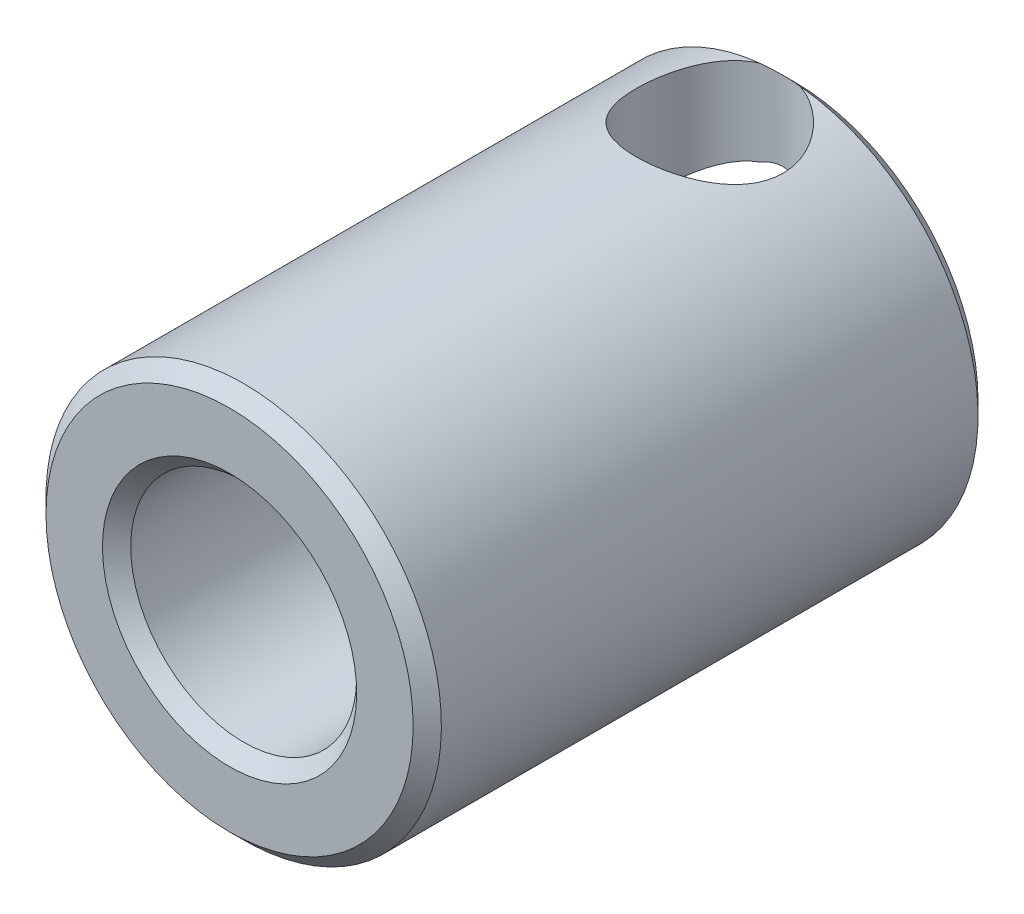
ISO-10303-21;
HEADER;
FILE_DESCRIPTION(('STEP AP214'),'2;1');
FILE_NAME('part.step','',(''),(''),'','','');
FILE_SCHEMA(('AUTOMOTIVE_DESIGN { 1 0 10303 214 1 1 1 1 }'));
ENDSEC;
DATA;
#1=APPLICATION_CONTEXT('core data for automotive mechanical design processes');
#2=APPLICATION_PROTOCOL_DEFINITION('international standard','automotive_design',2000,#1);
#3=PRODUCT_CONTEXT('',#1,'mechanical');
#4=PRODUCT('Part','Part','',(#3));
#5=PRODUCT_RELATED_PRODUCT_CATEGORY('part','',(#4));
#6=PRODUCT_DEFINITION_FORMATION('','',#4);
#7=PRODUCT_DEFINITION_CONTEXT('part definition',#1,'design');
#8=PRODUCT_DEFINITION('design','',#6,#7);
#9=PRODUCT_DEFINITION_SHAPE('','',#8);
#10=(LENGTH_UNIT() NAMED_UNIT(*) SI_UNIT(.MILLI.,.METRE.));
#11=(NAMED_UNIT(*) PLANE_ANGLE_UNIT() SI_UNIT($,.RADIAN.));
#12=(NAMED_UNIT(*) SI_UNIT($,.STERADIAN.) SOLID_ANGLE_UNIT());
#13=UNCERTAINTY_MEASURE_WITH_UNIT(LENGTH_MEASURE(1.E-05),#10,'distance_accuracy_value','');
#14=(GEOMETRIC_REPRESENTATION_CONTEXT(3) GLOBAL_UNCERTAINTY_ASSIGNED_CONTEXT((#13)) GLOBAL_UNIT_ASSIGNED_CONTEXT((#10,
#11,#12)) REPRESENTATION_CONTEXT('',''));
#15=CARTESIAN_POINT('',(0.,0.,0.));
#16=DIRECTION('',(0.,0.,1.));
#17=DIRECTION('',(1.,0.,0.));
#18=AXIS2_PLACEMENT_3D('',#15,#16,#17);
#19=CARTESIAN_POINT('',(0.,0.,20.));
#20=DIRECTION('',(0.,0.,-1.));
#21=DIRECTION('',(-1.,0.,0.));
#22=AXIS2_PLACEMENT_3D('',#19,#20,#21);
#23=CYLINDRICAL_SURFACE('',#22,7.);
#24=CARTESIAN_POINT('',(0.,0.,19.5));
#25=DIRECTION('',(0.,0.,1.));
#26=DIRECTION('',(0.,1.,0.));
#27=AXIS2_PLACEMENT_3D('',#24,#25,#26);
#28=CIRCLE('',#27,7.);
#29=CARTESIAN_POINT('',(0.,7.,19.5));
#30=VERTEX_POINT('',#29);
#31=EDGE_CURVE('E49',#30,#30,#28,.F.);
#32=ORIENTED_EDGE('',*,*,#31,.T.);
#33=EDGE_LOOP('',(#32));
#34=FACE_BOUND('',#33,.T.);
#35=CARTESIAN_POINT('',(0.,7.,0.4));
#36=CARTESIAN_POINT('',(0.140902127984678,7.00000340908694,0.399995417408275));
#37=CARTESIAN_POINT('',(0.281772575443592,6.99570847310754,0.411489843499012));
#38=CARTESIAN_POINT('',(0.559308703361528,6.97900377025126,0.456981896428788));
#39=CARTESIAN_POINT('',(0.69597489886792,6.96659500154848,0.490976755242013));
#40=CARTESIAN_POINT('',(0.961060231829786,6.93499607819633,0.580105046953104));
#41=CARTESIAN_POINT('',(1.08949454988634,6.9158188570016,0.635198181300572));
#42=CARTESIAN_POINT('',(1.33529005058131,6.87259728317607,0.764756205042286));
#43=CARTESIAN_POINT('',(1.45264831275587,6.84855165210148,0.839226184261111));
#44=CARTESIAN_POINT('',(1.67786429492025,6.79695712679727,1.00867578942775));
#45=CARTESIAN_POINT('',(1.78519764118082,6.76931039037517,1.10432230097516));
#46=CARTESIAN_POINT('',(1.98272113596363,6.71411603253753,1.31199410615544));
#47=CARTESIAN_POINT('',(2.07290618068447,6.68656844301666,1.42402425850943));
#48=CARTESIAN_POINT('',(2.23687620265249,6.63355869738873,1.66637033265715));
#49=CARTESIAN_POINT('',(2.309925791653,6.6082123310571,1.79721167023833));
#50=CARTESIAN_POINT('',(2.43275023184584,6.56399417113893,2.07041309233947));
#51=CARTESIAN_POINT('',(2.48253417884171,6.54511984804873,2.21276864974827));
#52=CARTESIAN_POINT('',(2.5553531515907,6.51702746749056,2.49892679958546));
#53=CARTESIAN_POINT('',(2.57938744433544,6.50745015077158,2.64243866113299));
#54=CARTESIAN_POINT('',(2.60314935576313,6.49798380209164,2.93175348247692));
#55=CARTESIAN_POINT('',(2.60288677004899,6.49809086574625,3.07755549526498));
#56=CARTESIAN_POINT('',(2.57882752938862,6.50767095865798,3.35822753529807));
#57=CARTESIAN_POINT('',(2.55640932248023,6.51659539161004,3.49323790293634));
#58=CARTESIAN_POINT('',(2.49095130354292,6.54189421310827,3.75742220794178));
#59=CARTESIAN_POINT('',(2.44790844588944,6.55826970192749,3.88659528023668));
#60=CARTESIAN_POINT('',(2.34165335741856,6.59696112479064,4.13827617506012));
#61=CARTESIAN_POINT('',(2.27807915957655,6.61938237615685,4.26061427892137));
#62=CARTESIAN_POINT('',(2.13281821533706,6.6676031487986,4.49328919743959));
#63=CARTESIAN_POINT('',(2.05112529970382,6.69340381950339,4.60362190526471));
#64=CARTESIAN_POINT('',(1.86561162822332,6.74754880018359,4.81679505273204));
#65=CARTESIAN_POINT('',(1.76068817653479,6.7759487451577,4.9186640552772));
#66=CARTESIAN_POINT('',(1.5349179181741,6.83062982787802,5.10364628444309));
#67=CARTESIAN_POINT('',(1.41406876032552,6.8569106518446,5.18675673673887));
#68=CARTESIAN_POINT('',(1.15743751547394,6.90489731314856,5.3329069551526));
#69=CARTESIAN_POINT('',(1.02145960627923,6.92652907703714,5.39562891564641));
#70=CARTESIAN_POINT('',(0.739879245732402,6.96223204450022,5.49698648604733));
#71=CARTESIAN_POINT('',(0.594281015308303,6.9763065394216,5.5356325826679));
#72=CARTESIAN_POINT('',(0.305773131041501,6.99473357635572,5.58588709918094));
#73=CARTESIAN_POINT('',(0.163121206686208,6.99955613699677,5.59880404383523));
#74=CARTESIAN_POINT('',(-0.122376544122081,7.00038457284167,5.60103632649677));
#75=CARTESIAN_POINT('',(-0.265222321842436,6.99639235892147,5.59035677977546));
#76=CARTESIAN_POINT('',(-0.541435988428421,6.98035004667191,5.54669781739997));
#77=CARTESIAN_POINT('',(-0.674958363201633,6.96860812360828,5.51457074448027));
#78=CARTESIAN_POINT('',(-0.934627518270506,6.93855669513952,5.43004585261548));
#79=CARTESIAN_POINT('',(-1.06077333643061,6.92024633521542,5.37764539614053));
#80=CARTESIAN_POINT('',(-1.30622972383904,6.87820684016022,5.25239914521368));
#81=CARTESIAN_POINT('',(-1.42523360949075,6.85433523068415,5.17900159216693));
#82=CARTESIAN_POINT('',(-1.64963112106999,6.80382009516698,5.01447034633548));
#83=CARTESIAN_POINT('',(-1.75501976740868,6.77717556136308,4.9233301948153));
#84=CARTESIAN_POINT('',(-1.95546470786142,6.72217031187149,4.71979576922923));
#85=CARTESIAN_POINT('',(-2.04959193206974,6.69379820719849,4.60648723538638));
#86=CARTESIAN_POINT('',(-2.21767356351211,6.64001014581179,4.36511926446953));
#87=CARTESIAN_POINT('',(-2.29162634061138,6.61459442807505,4.23705863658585));
#88=CARTESIAN_POINT('',(-2.41728845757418,6.56971904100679,3.96887010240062));
#89=CARTESIAN_POINT('',(-2.46891958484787,6.55028038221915,3.82870179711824));
#90=CARTESIAN_POINT('',(-2.54751642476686,6.52012013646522,3.54073962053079));
#91=CARTESIAN_POINT('',(-2.57449700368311,6.50939329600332,3.39295040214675));
#92=CARTESIAN_POINT('',(-2.60171215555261,6.49856044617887,3.10398712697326));
#93=CARTESIAN_POINT('',(-2.60352712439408,6.49782691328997,2.96298416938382));
#94=CARTESIAN_POINT('',(-2.58439424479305,6.50546005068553,2.68279574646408));
#95=CARTESIAN_POINT('',(-2.56344847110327,6.51382589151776,2.54361011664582));
#96=CARTESIAN_POINT('',(-2.50061005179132,6.53819746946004,2.27515018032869));
#97=CARTESIAN_POINT('',(-2.45935063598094,6.55397162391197,2.14570484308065));
#98=CARTESIAN_POINT('',(-2.35760940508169,6.59125168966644,1.8954955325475));
#99=CARTESIAN_POINT('',(-2.29712277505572,6.61275903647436,1.77473374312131));
#100=CARTESIAN_POINT('',(-2.15501364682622,6.66046565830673,1.53853411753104));
#101=CARTESIAN_POINT('',(-2.07246017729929,6.68685000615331,1.42369421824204));
#102=CARTESIAN_POINT('',(-1.89001350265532,6.74068894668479,1.20899196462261));
#103=CARTESIAN_POINT('',(-1.7901148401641,6.76814387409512,1.10913434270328));
#104=CARTESIAN_POINT('',(-1.5695204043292,6.82276788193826,0.921872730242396));
#105=CARTESIAN_POINT('',(-1.44800627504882,6.84984571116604,0.835401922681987));
#106=CARTESIAN_POINT('',(-1.19122351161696,6.899134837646,0.684144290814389));
#107=CARTESIAN_POINT('',(-1.0559542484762,6.92134591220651,0.619358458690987));
#108=CARTESIAN_POINT('',(-0.770373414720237,6.95901970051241,0.511909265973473));
#109=CARTESIAN_POINT('',(-0.619699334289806,6.97421640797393,0.470107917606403));
#110=CARTESIAN_POINT('',(-0.312668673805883,6.99470230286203,0.414162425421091));
#111=CARTESIAN_POINT('',(-0.156314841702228,6.99999621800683,0.400005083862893));
#112=CARTESIAN_POINT('',(0.,7.,0.4));
#113=B_SPLINE_CURVE_WITH_KNOTS('',3,(#35,#36,#37,#38,#39,#40,#41,#42,#43,#44,#45,#46,#47,#48,
#49,#50,#51,#52,#53,#54,#55,#56,#57,#58,#59,#60,#61,#62,#63,#64,#65,#66,#67,#68,#69,#70,#71,#72,
#73,#74,#75,#76,#77,#78,#79,#80,#81,#82,#83,#84,#85,#86,#87,#88,#89,#90,#91,#92,#93,#94,#95,#96,
#97,#98,#99,#100,#101,#102,#103,#104,#105,#106,#107,#108,#109,#110,#111,#112),.UNSPECIFIED.,.T.,
.F.,(4,2,2,2,2,2,2,2,2,2,2,2,2,2,2,2,2,2,2,2,2,2,2,2,2,2,2,2,2,2,2,2,2,2,2,2,2,2,4),(0.,
0.42212993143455,0.844207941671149,1.26548375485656,1.68687033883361,2.12412948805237,
2.56151857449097,3.01518807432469,3.46868006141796,3.90385364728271,4.33885178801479,
4.74838765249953,5.15798401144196,5.57523654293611,5.99263136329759,6.43750488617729,
6.88244416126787,7.33401897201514,7.78539695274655,8.213164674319,8.64083967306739,
9.05245687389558,9.46412764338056,9.88780578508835,10.3116384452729,10.7595862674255,
11.2075702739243,11.6571114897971,12.1063814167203,12.5272995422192,12.9481793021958,
13.3566987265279,13.7653205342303,14.1950659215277,14.6249467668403,15.0774737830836,
15.5300215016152,15.9985502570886,16.4668552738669),.UNSPECIFIED.);
#114=CARTESIAN_POINT('',(0.714142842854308,6.96347614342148,0.499999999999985));
#115=VERTEX_POINT('',#114);
#116=CARTESIAN_POINT('',(-0.714142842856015,6.96347614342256,0.499999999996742));
#117=VERTEX_POINT('',#116);
#118=EDGE_CURVE('E58',#115,#117,#113,.T.);
#119=ORIENTED_EDGE('',*,*,#118,.T.);
#120=CARTESIAN_POINT('',(0.,0.,0.5));
#121=DIRECTION('',(0.,0.,1.));
#122=DIRECTION('',(0.,1.,0.));
#123=AXIS2_PLACEMENT_3D('',#120,#121,#122);
#124=CIRCLE('',#123,7.);
#125=EDGE_CURVE('E195',#117,#115,#124,.T.);
#126=ORIENTED_EDGE('',*,*,#125,.T.);
#127=EDGE_LOOP('',(#119,#126));
#128=FACE_BOUND('',#127,.T.);
#129=ADVANCED_FACE('F14',(#34,#128),#23,.T.);
#130=CARTESIAN_POINT('',(0.,0.,20.));
#131=DIRECTION('',(0.,0.,-1.));
#132=DIRECTION('',(-1.,0.,0.));
#133=AXIS2_PLACEMENT_3D('',#130,#131,#132);
#134=CYLINDRICAL_SURFACE('',#133,4.);
#135=CARTESIAN_POINT('',(0.,0.,19.5));
#136=DIRECTION('',(0.,0.,1.));
#137=DIRECTION('',(0.,1.,0.));
#138=AXIS2_PLACEMENT_3D('',#135,#136,#137);
#139=CIRCLE('',#138,4.);
#140=CARTESIAN_POINT('',(0.,4.,19.5));
#141=VERTEX_POINT('',#140);
#142=EDGE_CURVE('E54',#141,#141,#139,.T.);
#143=ORIENTED_EDGE('',*,*,#142,.T.);
#144=EDGE_LOOP('',(#143));
#145=FACE_BOUND('',#144,.T.);
#146=CARTESIAN_POINT('',(0.,4.,0.4));
#147=CARTESIAN_POINT('',(-0.131242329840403,3.99999329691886,0.40000738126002));
#148=CARTESIAN_POINT('',(-0.26254087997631,3.9934798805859,0.409997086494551));
#149=CARTESIAN_POINT('',(-0.520991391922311,3.96805748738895,0.449372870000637));
#150=CARTESIAN_POINT('',(-0.648139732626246,3.94913797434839,0.478775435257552));
#151=CARTESIAN_POINT('',(-0.894153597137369,3.90078759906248,0.555206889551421));
#152=CARTESIAN_POINT('',(-1.01305512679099,3.87140638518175,0.602152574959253));
#153=CARTESIAN_POINT('',(-1.24084842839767,3.8045247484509,0.711706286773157));
#154=CARTESIAN_POINT('',(-1.3497392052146,3.76702351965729,0.774315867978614));
#155=CARTESIAN_POINT('',(-1.56461434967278,3.68325347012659,0.919101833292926));
#156=CARTESIAN_POINT('',(-1.66960870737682,3.63651545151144,1.00247034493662));
#157=CARTESIAN_POINT('',(-1.86507260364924,3.54025458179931,1.18360410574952));
#158=CARTESIAN_POINT('',(-1.95552160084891,3.49072792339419,1.28138934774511));
#159=CARTESIAN_POINT('',(-2.13305930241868,3.38558669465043,1.50552739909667));
#160=CARTESIAN_POINT('',(-2.21764773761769,3.33016214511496,1.63396599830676));
#161=CARTESIAN_POINT('',(-2.36387198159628,3.22801420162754,1.90642481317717));
#162=CARTESIAN_POINT('',(-2.42554737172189,3.1812758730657,2.05041759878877));
#163=CARTESIAN_POINT('',(-2.50925136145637,3.11539311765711,2.30955747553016));
#164=CARTESIAN_POINT('',(-2.53752995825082,3.09219132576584,2.42164521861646));
#165=CARTESIAN_POINT('',(-2.57898335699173,3.05771041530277,2.65029679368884));
#166=CARTESIAN_POINT('',(-2.59218224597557,3.04641228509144,2.7668531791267));
#167=CARTESIAN_POINT('',(-2.60266135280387,3.03746806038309,3.00162985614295));
#168=CARTESIAN_POINT('',(-2.59988682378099,3.03986891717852,3.11985448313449));
#169=CARTESIAN_POINT('',(-2.57849148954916,3.05803219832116,3.35385226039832));
#170=CARTESIAN_POINT('',(-2.55985742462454,3.07380580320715,3.46962327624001));
#171=CARTESIAN_POINT('',(-2.50881501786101,3.1155853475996,3.6916580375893));
#172=CARTESIAN_POINT('',(-2.4769094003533,3.14121548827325,3.7981125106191));
#173=CARTESIAN_POINT('',(-2.40072387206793,3.19981705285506,4.00430078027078));
#174=CARTESIAN_POINT('',(-2.35643988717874,3.23279089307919,4.10403235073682));
#175=CARTESIAN_POINT('',(-2.24673614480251,3.31021385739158,4.3148988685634));
#176=CARTESIAN_POINT('',(-2.17886980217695,3.3556433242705,4.42439872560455));
#177=CARTESIAN_POINT('',(-2.02828712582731,3.44875456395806,4.63171492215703));
#178=CARTESIAN_POINT('',(-1.94555285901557,3.49643900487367,4.72951691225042));
#179=CARTESIAN_POINT('',(-1.74873460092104,3.5995192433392,4.93010851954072));
#180=CARTESIAN_POINT('',(-1.63168281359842,3.65461273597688,5.03017369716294));
#181=CARTESIAN_POINT('',(-1.37948895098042,3.75705675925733,5.20926550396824));
#182=CARTESIAN_POINT('',(-1.24436566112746,3.80441521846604,5.2883137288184));
#183=CARTESIAN_POINT('',(-0.987177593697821,3.87810197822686,5.40862009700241));
#184=CARTESIAN_POINT('',(-0.867825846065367,3.90673767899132,5.4542618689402));
#185=CARTESIAN_POINT('',(-0.62180392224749,3.95335158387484,5.52780629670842));
#186=CARTESIAN_POINT('',(-0.495139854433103,3.97133854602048,5.55572353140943));
#187=CARTESIAN_POINT('',(-0.23742381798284,3.99505026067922,5.59241697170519));
#188=CARTESIAN_POINT('',(-0.106357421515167,4.00072966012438,5.60112238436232));
#189=CARTESIAN_POINT('',(0.155513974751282,3.99911931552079,5.5986452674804));
#190=CARTESIAN_POINT('',(0.28631897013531,3.99182935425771,5.5874624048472));
#191=CARTESIAN_POINT('',(0.535832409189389,3.96581617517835,5.54713828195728));
#192=CARTESIAN_POINT('',(0.654798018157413,3.94779725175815,5.51910232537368));
#193=CARTESIAN_POINT('',(0.885994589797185,3.90242300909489,5.44738115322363));
#194=CARTESIAN_POINT('',(0.998224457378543,3.87506617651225,5.40369340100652));
#195=CARTESIAN_POINT('',(1.22143058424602,3.81084256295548,5.29877417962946));
#196=CARTESIAN_POINT('',(1.3317766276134,3.77344664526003,5.2365337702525));
#197=CARTESIAN_POINT('',(1.54093180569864,3.69298130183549,5.09792655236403));
#198=CARTESIAN_POINT('',(1.63973252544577,3.64990778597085,5.02154954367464));
#199=CARTESIAN_POINT('',(1.83914998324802,3.55409295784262,4.84338905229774));
#200=CARTESIAN_POINT('',(1.93766759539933,3.50088886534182,4.73950211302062));
#201=CARTESIAN_POINT('',(2.11669261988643,3.3956438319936,4.51659420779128));
#202=CARTESIAN_POINT('',(2.19719270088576,3.34360337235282,4.39756711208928));
#203=CARTESIAN_POINT('',(2.32999289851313,3.25220537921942,4.16073084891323));
#204=CARTESIAN_POINT('',(2.38451159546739,3.21207543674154,4.0444705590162));
#205=CARTESIAN_POINT('',(2.47639525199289,3.14178831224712,3.8025770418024));
#206=CARTESIAN_POINT('',(2.51379111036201,3.11161319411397,3.67696117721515));
#207=CARTESIAN_POINT('',(2.56522627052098,3.06929348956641,3.43837701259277));
#208=CARTESIAN_POINT('',(2.58193539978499,3.05511753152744,3.32635400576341));
#209=CARTESIAN_POINT('',(2.6005371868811,3.03930433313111,3.10023470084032));
#210=CARTESIAN_POINT('',(2.60244128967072,3.03765740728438,2.98614007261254));
#211=CARTESIAN_POINT('',(2.59132574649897,3.04714201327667,2.75933297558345));
#212=CARTESIAN_POINT('',(2.57831712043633,3.05826410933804,2.64661954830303));
#213=CARTESIAN_POINT('',(2.53820790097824,3.09162789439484,2.42538703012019));
#214=CARTESIAN_POINT('',(2.51108917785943,3.11388388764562,2.31687352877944));
#215=CARTESIAN_POINT('',(2.43418115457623,3.1745537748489,2.07522359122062));
#216=CARTESIAN_POINT('',(2.38007932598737,3.21579043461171,1.94417788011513));
#217=CARTESIAN_POINT('',(2.25291901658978,3.30612081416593,1.69460918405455));
#218=CARTESIAN_POINT('',(2.17983462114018,3.35522523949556,1.57610363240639));
#219=CARTESIAN_POINT('',(2.01515794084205,3.45667900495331,1.35110588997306));
#220=CARTESIAN_POINT('',(1.92329614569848,3.50906686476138,1.24482856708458));
#221=CARTESIAN_POINT('',(1.72305889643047,3.61161392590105,1.04786851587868));
#222=CARTESIAN_POINT('',(1.61467948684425,3.66177258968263,0.957189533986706));
#223=CARTESIAN_POINT('',(1.37081527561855,3.76028651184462,0.785228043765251));
#224=CARTESIAN_POINT('',(1.23370112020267,3.80795408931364,0.705805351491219));
#225=CARTESIAN_POINT('',(1.01672423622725,3.8693611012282,0.6057087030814));
#226=CARTESIAN_POINT('',(0.942542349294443,3.88814289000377,0.575523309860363));
#227=CARTESIAN_POINT('',(0.79093276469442,3.92179078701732,0.521919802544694));
#228=CARTESIAN_POINT('',(0.713506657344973,3.93665878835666,0.498498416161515));
#229=CARTESIAN_POINT('',(0.531962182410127,3.96583403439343,0.452797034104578));
#230=CARTESIAN_POINT('',(0.426930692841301,3.97857524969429,0.433063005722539));
#231=CARTESIAN_POINT('',(0.214611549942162,3.99565973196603,0.406663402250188));
#232=CARTESIAN_POINT('',(0.107324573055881,4.00000548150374,0.3999939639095));
#233=CARTESIAN_POINT('',(0.,4.,0.4));
#234=B_SPLINE_CURVE_WITH_KNOTS('',3,(#146,#147,#148,#149,#150,#151,#152,#153,#154,#155,#156,
#157,#158,#159,#160,#161,#162,#163,#164,#165,#166,#167,#168,#169,#170,#171,#172,#173,#174,#175,
#176,#177,#178,#179,#180,#181,#182,#183,#184,#185,#186,#187,#188,#189,#190,#191,#192,#193,#194,
#195,#196,#197,#198,#199,#200,#201,#202,#203,#204,#205,#206,#207,#208,#209,#210,#211,#212,#213,
#214,#215,#216,#217,#218,#219,#220,#221,#222,#223,#224,#225,#226,#227,#228,#229,#230,#231,#232,
#233),.UNSPECIFIED.,.T.,.F.,(4,2,2,2,2,2,2,2,2,2,2,2,2,2,2,2,2,2,2,2,2,2,2,2,2,2,2,2,2,2,2,2,2,
2,2,2,2,2,2,2,2,2,2,4),(0.,0.393303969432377,0.786942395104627,1.1787370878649,1.57057068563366,
1.99490086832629,2.419825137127,2.90794425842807,3.39521620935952,3.74750251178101,
4.09922531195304,4.45215431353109,4.8053786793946,5.1462917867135,5.48731723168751,
5.89565988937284,6.30449842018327,6.79278996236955,7.28057781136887,7.67176869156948,
8.0626373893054,8.45494399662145,8.8472571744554,9.21628489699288,9.58537245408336,
9.98013330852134,10.3751801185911,10.8315540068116,11.288113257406,11.6902028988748,
12.0915640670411,12.4324642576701,12.7731008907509,13.1134859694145,13.4543094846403,
13.8949021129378,14.3360994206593,14.7841406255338,15.2322892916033,15.7254702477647,
15.9718878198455,16.2181859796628,16.5399089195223,16.8615367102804),.UNSPECIFIED.);
#235=CARTESIAN_POINT('',(-0.714142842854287,3.93573373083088,0.5));
#236=VERTEX_POINT('',#235);
#237=CARTESIAN_POINT('',(0.714142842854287,3.93573373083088,0.5));
#238=VERTEX_POINT('',#237);
#239=EDGE_CURVE('E53',#236,#238,#234,.T.);
#240=ORIENTED_EDGE('',*,*,#239,.T.);
#241=CARTESIAN_POINT('',(0.,0.,0.5));
#242=DIRECTION('',(0.,0.,1.));
#243=DIRECTION('',(0.,1.,0.));
#244=AXIS2_PLACEMENT_3D('',#241,#242,#243);
#245=CIRCLE('',#244,4.);
#246=EDGE_CURVE('E45',#238,#236,#245,.F.);
#247=ORIENTED_EDGE('',*,*,#246,.T.);
#248=EDGE_LOOP('',(#240,#247));
#249=FACE_BOUND('',#248,.T.);
#250=ADVANCED_FACE('F52',(#145,#249),#134,.F.);
#251=CARTESIAN_POINT('',(0.,0.,20.));
#252=DIRECTION('',(0.,0.,1.));
#253=DIRECTION('',(1.,0.,0.));
#254=AXIS2_PLACEMENT_3D('',#251,#252,#253);
#255=PLANE('',#254);
#256=CARTESIAN_POINT('',(0.,0.,20.));
#257=DIRECTION('',(0.,0.,1.));
#258=DIRECTION('',(0.,1.,0.));
#259=AXIS2_PLACEMENT_3D('',#256,#257,#258);
#260=CIRCLE('',#259,6.5);
#261=CARTESIAN_POINT('',(0.,6.5,20.));
#262=VERTEX_POINT('',#261);
#263=EDGE_CURVE('E9',#262,#262,#260,.T.);
#264=ORIENTED_EDGE('',*,*,#263,.T.);
#265=EDGE_LOOP('',(#264));
#266=FACE_BOUND('',#265,.T.);
#267=CARTESIAN_POINT('',(0.,0.,20.));
#268=DIRECTION('',(0.,0.,1.));
#269=DIRECTION('',(0.,1.,0.));
#270=AXIS2_PLACEMENT_3D('',#267,#268,#269);
#271=CIRCLE('',#270,4.5);
#272=CARTESIAN_POINT('',(0.,4.5,20.));
#273=VERTEX_POINT('',#272);
#274=EDGE_CURVE('E22',#273,#273,#271,.F.);
#275=ORIENTED_EDGE('',*,*,#274,.T.);
#276=EDGE_LOOP('',(#275));
#277=FACE_BOUND('',#276,.T.);
#278=ADVANCED_FACE('F119',(#266,#277),#255,.T.);
#279=CARTESIAN_POINT('',(0.,0.,0.));
#280=DIRECTION('',(0.,0.,1.));
#281=DIRECTION('',(1.,0.,0.));
#282=AXIS2_PLACEMENT_3D('',#279,#280,#281);
#283=PLANE('',#282);
#284=CARTESIAN_POINT('',(0.,0.,0.));
#285=DIRECTION('',(0.,0.,1.));
#286=DIRECTION('',(0.,1.,0.));
#287=AXIS2_PLACEMENT_3D('',#284,#285,#286);
#288=CIRCLE('',#287,4.5);
#289=CARTESIAN_POINT('',(0.,4.5,0.));
#290=VERTEX_POINT('',#289);
#291=EDGE_CURVE('E61',#290,#290,#288,.T.);
#292=ORIENTED_EDGE('',*,*,#291,.T.);
#293=EDGE_LOOP('',(#292));
#294=FACE_BOUND('',#293,.T.);
#295=CARTESIAN_POINT('',(0.,0.,0.));
#296=DIRECTION('',(0.,0.,1.));
#297=DIRECTION('',(0.,1.,0.));
#298=AXIS2_PLACEMENT_3D('',#295,#296,#297);
#299=CIRCLE('',#298,6.5);
#300=CARTESIAN_POINT('',(0.,6.5,0.));
#301=VERTEX_POINT('',#300);
#302=EDGE_CURVE('E57',#301,#301,#299,.F.);
#303=ORIENTED_EDGE('',*,*,#302,.T.);
#304=EDGE_LOOP('',(#303));
#305=FACE_BOUND('',#304,.T.);
#306=ADVANCED_FACE('F78',(#294,#305),#283,.F.);
#307=CARTESIAN_POINT('',(0.,7.001,3.));
#308=DIRECTION('',(0.,-1.,0.));
#309=DIRECTION('',(0.,0.,-1.));
#310=AXIS2_PLACEMENT_3D('',#307,#308,#309);
#311=CYLINDRICAL_SURFACE('',#310,2.6);
#312=ORIENTED_EDGE('',*,*,#239,.F.);
#313=CARTESIAN_POINT('',(-0.714142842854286,3.93573373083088,0.5));
#314=CARTESIAN_POINT('',(-0.677819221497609,3.95286932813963,0.489624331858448));
#315=CARTESIAN_POINT('',(-0.640790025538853,3.96889376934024,0.479903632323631));
#316=CARTESIAN_POINT('',(-0.565383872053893,3.99849884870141,0.461920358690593));
#317=CARTESIAN_POINT('',(-0.527005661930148,4.0120771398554,0.453659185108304));
#318=CARTESIAN_POINT('',(-0.410284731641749,4.04868972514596,0.431360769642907));
#319=CARTESIAN_POINT('',(-0.330134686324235,4.06770824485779,0.419743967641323));
#320=CARTESIAN_POINT('',(-0.166588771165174,4.09341050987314,0.404034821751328));
#321=CARTESIAN_POINT('',(-0.0831750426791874,4.10001243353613,0.399992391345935));
#322=CARTESIAN_POINT('',(0.0836496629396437,4.09998753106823,0.400007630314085));
#323=CARTESIAN_POINT('',(0.167060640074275,4.09336071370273,0.404065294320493));
#324=CARTESIAN_POINT('',(0.330519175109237,4.06762348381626,0.419795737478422));
#325=CARTESIAN_POINT('',(0.410587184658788,4.04860658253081,0.431411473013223));
#326=CARTESIAN_POINT('',(0.527190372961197,4.01201326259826,0.453698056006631));
#327=CARTESIAN_POINT('',(0.565529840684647,3.99844438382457,0.461953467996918));
#328=CARTESIAN_POINT('',(0.640861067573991,3.96886303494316,0.479922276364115));
#329=CARTESIAN_POINT('',(0.67785407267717,3.9528528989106,0.489634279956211));
#330=CARTESIAN_POINT('',(0.714142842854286,3.93573373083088,0.5));
#331=B_SPLINE_CURVE_WITH_KNOTS('',3,(#313,#314,#315,#316,#317,#318,#319,#320,#321,#322,#323,
#324,#325,#326,#327,#328,#329,#330),.UNSPECIFIED.,.F.,.F.,(4,2,2,2,2,2,2,2,4),(0.,
0.124398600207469,0.248915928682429,0.497197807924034,0.747110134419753,0.997022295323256,
1.24506981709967,1.3694673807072,1.4937467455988),.UNSPECIFIED.);
#332=EDGE_CURVE('E41',#236,#238,#331,.T.);
#333=ORIENTED_EDGE('',*,*,#332,.T.);
#334=EDGE_LOOP('',(#312,#333));
#335=FACE_BOUND('',#334,.T.);
#336=ORIENTED_EDGE('',*,*,#118,.F.);
#337=CARTESIAN_POINT('',(0.714142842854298,6.96347614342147,0.5));
#338=CARTESIAN_POINT('',(0.654310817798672,6.95242947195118,0.482897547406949));
#339=CARTESIAN_POINT('',(0.593612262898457,6.94282765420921,0.467892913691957));
#340=CARTESIAN_POINT('',(0.470919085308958,6.92650900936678,0.442237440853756));
#341=CARTESIAN_POINT('',(0.408924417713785,6.91979228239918,0.431586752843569));
#342=CARTESIAN_POINT('',(0.28576411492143,6.90938219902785,0.415024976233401));
#343=CARTESIAN_POINT('',(0.22462122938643,6.90561217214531,0.408993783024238));
#344=CARTESIAN_POINT('',(0.101981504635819,6.90079213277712,0.401273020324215));
#345=CARTESIAN_POINT('',(0.040484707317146,6.89974180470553,0.399582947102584));
#346=CARTESIAN_POINT('',(-0.137138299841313,6.9006403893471,0.401032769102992));
#347=CARTESIAN_POINT('',(-0.253296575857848,6.90607960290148,0.409792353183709));
#348=CARTESIAN_POINT('',(-0.426594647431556,6.92165943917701,0.434543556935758));
#349=CARTESIAN_POINT('',(-0.484954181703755,6.92822543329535,0.444943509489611));
#350=CARTESIAN_POINT('',(-0.600502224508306,6.94392412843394,0.469608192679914));
#351=CARTESIAN_POINT('',(-0.657690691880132,6.9530569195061,0.483873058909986));
#352=CARTESIAN_POINT('',(-0.714142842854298,6.96347614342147,0.5));
#353=B_SPLINE_CURVE_WITH_KNOTS('',3,(#337,#338,#339,#340,#341,#342,#343,#344,#345,#346,#347,
#348,#349,#350,#351,#352),.UNSPECIFIED.,.F.,.F.,(4,2,2,2,2,2,2,4),(0.,0.189546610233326,
0.379099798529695,0.563539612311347,0.747958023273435,1.09609240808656,1.27485844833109,
1.45363076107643),.UNSPECIFIED.);
#354=EDGE_CURVE('E28',#115,#117,#353,.T.);
#355=ORIENTED_EDGE('',*,*,#354,.T.);
#356=EDGE_LOOP('',(#336,#355));
#357=FACE_BOUND('',#356,.T.);
#358=ADVANCED_FACE('F56',(#335,#357),#311,.F.);
#359=CARTESIAN_POINT('',(0.,0.,0.));
#360=DIRECTION('',(0.,0.,-1.));
#361=DIRECTION('',(0.,-1.,0.));
#362=AXIS2_PLACEMENT_3D('',#359,#360,#361);
#363=CONICAL_SURFACE('',#362,4.5,0.785398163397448);
#364=ORIENTED_EDGE('',*,*,#332,.F.);
#365=ORIENTED_EDGE('',*,*,#246,.F.);
#366=EDGE_LOOP('',(#364,#365));
#367=FACE_BOUND('',#366,.T.);
#368=ORIENTED_EDGE('',*,*,#291,.F.);
#369=EDGE_LOOP('',(#368));
#370=FACE_BOUND('',#369,.T.);
#371=ADVANCED_FACE('F43',(#367,#370),#363,.F.);
#372=CARTESIAN_POINT('',(0.,0.,0.5));
#373=DIRECTION('',(0.,0.,1.));
#374=DIRECTION('',(0.,1.,0.));
#375=AXIS2_PLACEMENT_3D('',#372,#373,#374);
#376=CONICAL_SURFACE('',#375,7.,0.785398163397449);
#377=ORIENTED_EDGE('',*,*,#302,.F.);
#378=EDGE_LOOP('',(#377));
#379=FACE_BOUND('',#378,.T.);
#380=ORIENTED_EDGE('',*,*,#354,.F.);
#381=ORIENTED_EDGE('',*,*,#125,.F.);
#382=EDGE_LOOP('',(#380,#381));
#383=FACE_BOUND('',#382,.T.);
#384=ADVANCED_FACE('F96',(#379,#383),#376,.T.);
#385=CARTESIAN_POINT('',(0.,0.,20.));
#386=DIRECTION('',(0.,0.,-1.));
#387=DIRECTION('',(0.,-1.,0.));
#388=AXIS2_PLACEMENT_3D('',#385,#386,#387);
#389=CONICAL_SURFACE('',#388,6.5,0.785398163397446);
#390=ORIENTED_EDGE('',*,*,#31,.F.);
#391=EDGE_LOOP('',(#390));
#392=FACE_BOUND('',#391,.T.);
#393=ORIENTED_EDGE('',*,*,#263,.F.);
#394=EDGE_LOOP('',(#393));
#395=FACE_BOUND('',#394,.T.);
#396=ADVANCED_FACE('F99',(#392,#395),#389,.T.);
#397=CARTESIAN_POINT('',(0.,0.,19.5));
#398=DIRECTION('',(0.,0.,1.));
#399=DIRECTION('',(0.,1.,0.));
#400=AXIS2_PLACEMENT_3D('',#397,#398,#399);
#401=CONICAL_SURFACE('',#400,4.,0.785398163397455);
#402=ORIENTED_EDGE('',*,*,#274,.F.);
#403=EDGE_LOOP('',(#402));
#404=FACE_BOUND('',#403,.T.);
#405=ORIENTED_EDGE('',*,*,#142,.F.);
#406=EDGE_LOOP('',(#405));
#407=FACE_BOUND('',#406,.T.);
#408=ADVANCED_FACE('F16',(#404,#407),#401,.F.);
#409=CLOSED_SHELL('',(#129,#250,#278,#306,#358,#371,#384,#396,#408));
#410=MANIFOLD_SOLID_BREP('B1',#409);
#411=ADVANCED_BREP_SHAPE_REPRESENTATION('',(#18,#410),#14);
#412=SHAPE_DEFINITION_REPRESENTATION(#9,#411);
ENDSEC;
END-ISO-10303-21;
